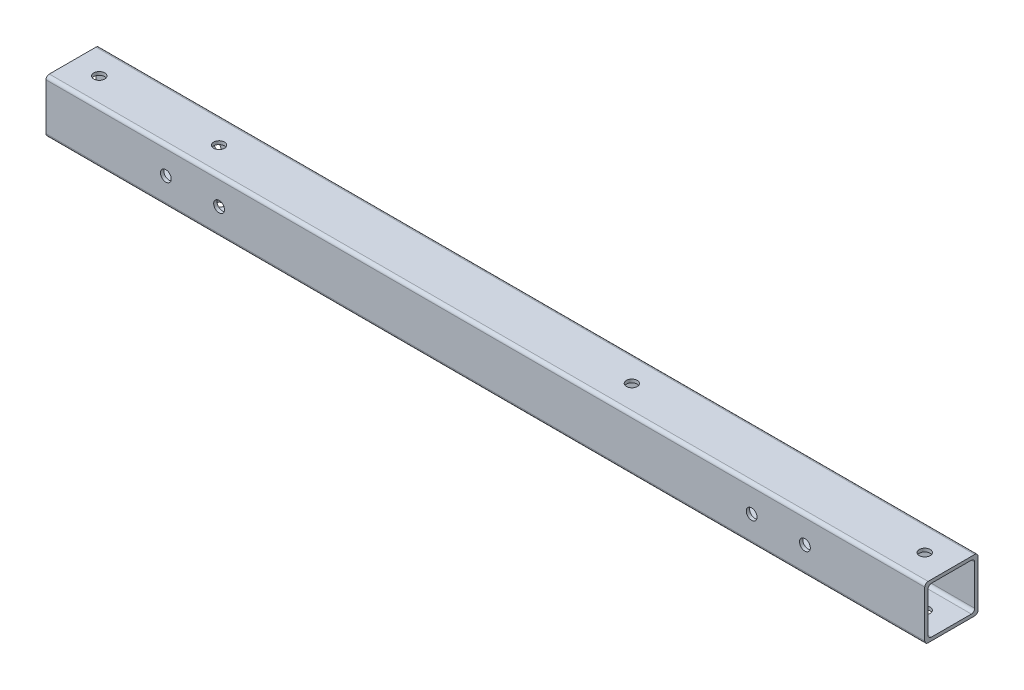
from build123d import *

# Parameters (mm, degrees)
SKETCH1_W          = 1676.4
SKETCH1_H          = 101.6
EXTRUDE1_DEPTH     = 101.6
CUT_EXTRUDE1_REACH = 1684.546
SKETCH2_W          = 88.9
SKETCH2_H          = 88.9
SKETCH3_R          = 10.31875
CUT_EXTRUDE2_DEPTH = 1683.546308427
FILLET1_R          = 6.35
SKETCH5_R          = 10.31875
CUT_EXTRUDE4_DEPTH = 101.6
SKETCH6_R          = 10.31875
CUT_EXTRUDE5_DEPTH = 101.6
SKETCH8_R          = 10.31875
CUT_EXTRUDE7_DEPTH = 101.6


with BuildPart() as part:
    # Sketch1 → Extrude1 (new body)
    with BuildSketch(Plane(origin=(0, 0, 0), x_dir=(1, 0, 0), z_dir=(0, 1, 0))):
        with Locations((-838.2, -50.8)):
            Rectangle(SKETCH1_W, SKETCH1_H)
    extrude(amount=EXTRUDE1_DEPTH)

    # Sketch2 → Cut-Extrude1 (cut, up to next)
    with BuildSketch(Plane.ZY.offset(1676.4), mode=Mode.PRIVATE) as cut_extrude1_sk1:
        with Locations((50.8, 50.8)):
            Rectangle(SKETCH2_W, SKETCH2_H)
    cut_extrude1_tool1 = extrude(cut_extrude1_sk1.sketch, amount=-CUT_EXTRUDE1_REACH, mode=Mode.PRIVATE) & part.part
    add(cut_extrude1_tool1.solids().sort_by_distance((-1676.4, 50.8, 50.8))[0], mode=Mode.SUBTRACT)

    # Sketch3 → Cut-Extrude2 (cut, through all)
    with BuildSketch(Plane(origin=(0, 101.6, 0), x_dir=(1, 0, 0), z_dir=(0, 1, 0))):
        with Locations(Location((-1625.6, -50.8, 0), (0, 0, 270))):
            Circle(SKETCH3_R)
    cut_extrude2 = extrude(amount=-CUT_EXTRUDE2_DEPTH, mode=Mode.SUBTRACT)

    # Fillet1
    fillet1_edges = [part.edges().sort_by_distance(p)[0] for p in [
        (-838.2, 101.6, 101.6),
        (-838.2, 6.35, 6.35),
        (-838.2, 95.25, 6.35),
        (-838.2, 95.25, 95.25),
        (-838.2, 6.35, 95.25),
        (-838.2, 0, 101.6),
        (-838.2, 0, 0),
        (-838.2, 101.6, 0),
    ]]
    fillet(fillet1_edges, radius=FILLET1_R)

    # Sketch5 → Cut-Extrude4 (cut)
    with BuildSketch(Plane(origin=(0, 0, 0), x_dir=(-1, 0, 0), z_dir=(0, 0, -1))):
        with Locations((1447.8, 50.8)):
            Circle(SKETCH5_R)
        with Locations((1346.2, 50.8)):
            Circle(SKETCH5_R)
    cut_extrude4 = extrude(amount=-CUT_EXTRUDE4_DEPTH, mode=Mode.SUBTRACT)

    # Mirror1: Cut-Extrude2, Cut-Extrude4 across plane
    add(cut_extrude2.mirror(Plane(origin=(-838.2, 0, 0), x_dir=(0, 0, 1), z_dir=(1, 0, 0))), mode=Mode.SUBTRACT)
    add(cut_extrude4.mirror(Plane(origin=(-838.2, 0, 0), x_dir=(0, 0, 1), z_dir=(1, 0, 0))), mode=Mode.SUBTRACT)

    # Sketch6 → Cut-Extrude5 (cut)
    with BuildSketch(Plane(origin=(0, 101.6, 0), x_dir=(1, 0, 0), z_dir=(0, 1, 0))):
        with Locations(Location((-609.6, -50.8, 0), (0, 0, 270))):
            Circle(SKETCH6_R)
    extrude(amount=-CUT_EXTRUDE5_DEPTH, mode=Mode.SUBTRACT)

    # Sketch8 → Cut-Extrude7 (cut)
    with BuildSketch(Plane(origin=(0, 101.6, 0), x_dir=(1, 0, 0), z_dir=(0, 1, 0))):
        with Locations(Location((-1397, -50.8, 0), (0, 0, 270))):
            Circle(SKETCH8_R)
    extrude(amount=-CUT_EXTRUDE7_DEPTH, mode=Mode.SUBTRACT)


solid = part.part
